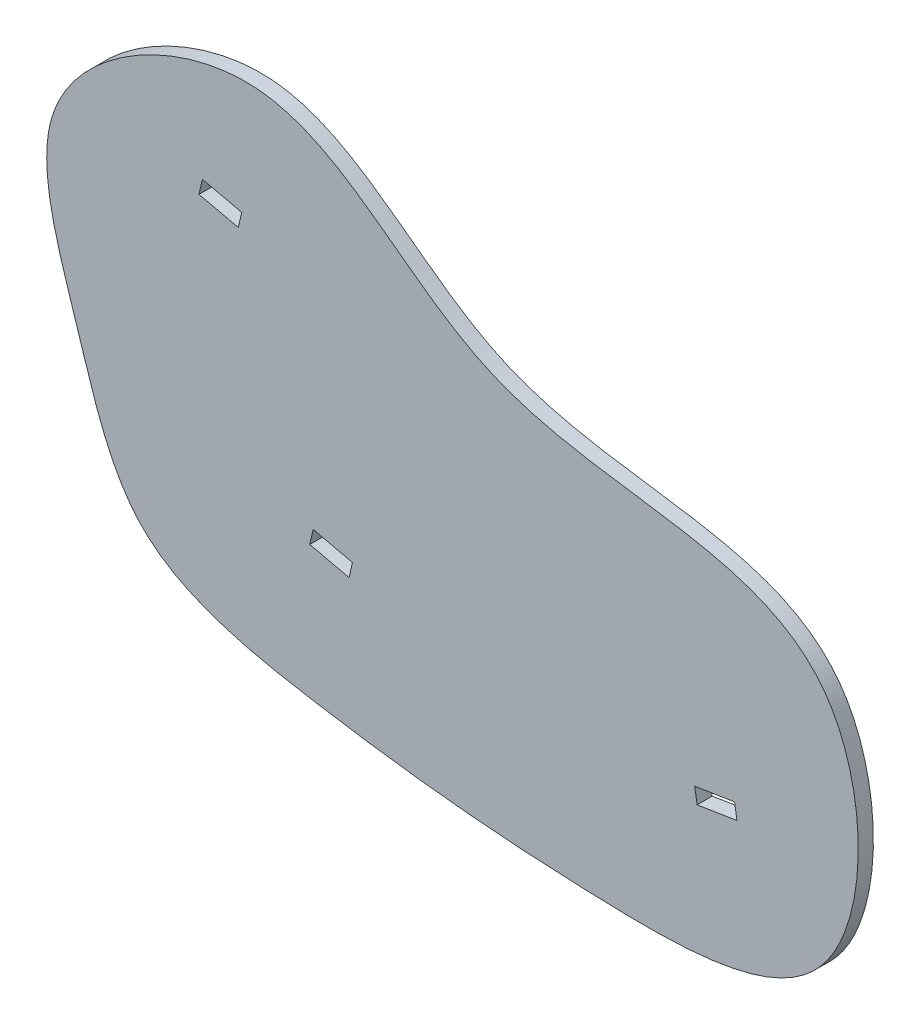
ISO-10303-21;
HEADER;
FILE_DESCRIPTION(('STEP AP214'),'2;1');
FILE_NAME('part.step','',(''),(''),'','','');
FILE_SCHEMA(('AUTOMOTIVE_DESIGN { 1 0 10303 214 1 1 1 1 }'));
ENDSEC;
DATA;
#1=APPLICATION_CONTEXT('core data for automotive mechanical design processes');
#2=APPLICATION_PROTOCOL_DEFINITION('international standard','automotive_design',2000,#1);
#3=PRODUCT_CONTEXT('',#1,'mechanical');
#4=PRODUCT('Part','Part','',(#3));
#5=PRODUCT_RELATED_PRODUCT_CATEGORY('part','',(#4));
#6=PRODUCT_DEFINITION_FORMATION('','',#4);
#7=PRODUCT_DEFINITION_CONTEXT('part definition',#1,'design');
#8=PRODUCT_DEFINITION('design','',#6,#7);
#9=PRODUCT_DEFINITION_SHAPE('','',#8);
#10=(LENGTH_UNIT() NAMED_UNIT(*) SI_UNIT(.MILLI.,.METRE.));
#11=(NAMED_UNIT(*) PLANE_ANGLE_UNIT() SI_UNIT($,.RADIAN.));
#12=(NAMED_UNIT(*) SI_UNIT($,.STERADIAN.) SOLID_ANGLE_UNIT());
#13=UNCERTAINTY_MEASURE_WITH_UNIT(LENGTH_MEASURE(1.E-05),#10,'distance_accuracy_value','');
#14=(GEOMETRIC_REPRESENTATION_CONTEXT(3) GLOBAL_UNCERTAINTY_ASSIGNED_CONTEXT((#13)) GLOBAL_UNIT_ASSIGNED_CONTEXT((#10,
#11,#12)) REPRESENTATION_CONTEXT('',''));
#15=CARTESIAN_POINT('',(0.,0.,0.));
#16=DIRECTION('',(0.,0.,1.));
#17=DIRECTION('',(1.,0.,0.));
#18=AXIS2_PLACEMENT_3D('',#15,#16,#17);
#19=CARTESIAN_POINT('',(-18.864168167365,58.9345778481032,3.));
#20=CARTESIAN_POINT('',(-34.265243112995,59.970351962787,3.));
#21=CARTESIAN_POINT('',(-68.7282783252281,40.4798839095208,3.));
#22=CARTESIAN_POINT('',(-54.0532926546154,1.33167403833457,3.));
#23=CARTESIAN_POINT('',(-44.653372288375,-33.4330483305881,3.));
#24=CARTESIAN_POINT('',(1.65807007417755,-42.880903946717,3.));
#25=CARTESIAN_POINT('',(42.2973272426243,-46.8441518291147,3.));
#26=CARTESIAN_POINT('',(102.968426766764,-46.4335205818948,3.));
#27=CARTESIAN_POINT('',(102.740932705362,33.6306735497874,3.));
#28=CARTESIAN_POINT('',(26.4618889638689,18.7347251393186,3.));
#29=CARTESIAN_POINT('',(-1.47242722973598,57.7649247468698,3.));
#30=CARTESIAN_POINT('',(-18.864168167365,58.9345778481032,3.));
#31=B_SPLINE_CURVE_WITH_KNOTS('',3,(#19,#20,#21,#22,#23,#24,#25,#26,#27,#28,#29,#30),
.UNSPECIFIED.,.T.,.F.,(4,1,1,1,1,1,1,1,1,4),(0.,0.110992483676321,0.194396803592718,
0.268191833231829,0.351801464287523,0.490835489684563,0.595467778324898,0.70673959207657,
0.874661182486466,1.),.UNSPECIFIED.);
#32=DIRECTION('',(0.,0.,-1.));
#33=VECTOR('',#32,1.);
#34=SURFACE_OF_LINEAR_EXTRUSION('',#31,#33);
#35=CARTESIAN_POINT('',(-18.864168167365,58.9345778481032,3.));
#36=VERTEX_POINT('',#35);
#37=EDGE_CURVE('E191',#36,#36,#31,.T.);
#38=ORIENTED_EDGE('',*,*,#37,.F.);
#39=EDGE_LOOP('',(#38));
#40=FACE_BOUND('',#39,.T.);
#41=CARTESIAN_POINT('',(-18.864168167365,58.9345778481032,0.));
#42=CARTESIAN_POINT('',(-34.265243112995,59.970351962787,0.));
#43=CARTESIAN_POINT('',(-68.7282783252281,40.4798839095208,0.));
#44=CARTESIAN_POINT('',(-54.0532926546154,1.33167403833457,0.));
#45=CARTESIAN_POINT('',(-44.653372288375,-33.4330483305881,0.));
#46=CARTESIAN_POINT('',(1.65807007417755,-42.880903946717,0.));
#47=CARTESIAN_POINT('',(42.2973272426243,-46.8441518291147,0.));
#48=CARTESIAN_POINT('',(102.968426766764,-46.4335205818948,0.));
#49=CARTESIAN_POINT('',(102.740932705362,33.6306735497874,0.));
#50=CARTESIAN_POINT('',(26.4618889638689,18.7347251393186,0.));
#51=CARTESIAN_POINT('',(-1.47242722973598,57.7649247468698,0.));
#52=CARTESIAN_POINT('',(-18.864168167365,58.9345778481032,0.));
#53=B_SPLINE_CURVE_WITH_KNOTS('',3,(#41,#42,#43,#44,#45,#46,#47,#48,#49,#50,#51,#52),
.UNSPECIFIED.,.T.,.F.,(4,1,1,1,1,1,1,1,1,4),(0.,0.110992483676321,0.194396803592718,
0.268191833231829,0.351801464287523,0.490835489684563,0.595467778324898,0.70673959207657,
0.874661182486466,1.),.UNSPECIFIED.);
#54=CARTESIAN_POINT('',(-18.864168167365,58.9345778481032,0.));
#55=VERTEX_POINT('',#54);
#56=EDGE_CURVE('E185',#55,#55,#53,.T.);
#57=ORIENTED_EDGE('',*,*,#56,.T.);
#58=EDGE_LOOP('',(#57));
#59=FACE_BOUND('',#58,.T.);
#60=ADVANCED_FACE('F32',(#40,#59),#34,.F.);
#61=CARTESIAN_POINT('',(54.4673267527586,-46.3127119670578,3.));
#62=DIRECTION('',(0.,0.,-1.));
#63=DIRECTION('',(-1.,0.,0.));
#64=AXIS2_PLACEMENT_3D('',#61,#62,#63);
#65=PLANE('',#64);
#66=DIRECTION('',(0.15643446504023,-0.987688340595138,0.));
#67=VECTOR('',#66,1.);
#68=CARTESIAN_POINT('',(68.1831600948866,-17.4597982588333,3.));
#69=LINE('',#68,#67);
#70=CARTESIAN_POINT('',(68.1831600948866,-17.4597982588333,3.));
#71=VERTEX_POINT('',#70);
#72=CARTESIAN_POINT('',(68.6524634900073,-20.4228632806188,3.));
#73=VERTEX_POINT('',#72);
#74=EDGE_CURVE('E155',#71,#73,#69,.T.);
#75=ORIENTED_EDGE('',*,*,#74,.F.);
#76=DIRECTION('',(-0.987688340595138,-0.15643446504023,0.));
#77=VECTOR('',#76,1.);
#78=CARTESIAN_POINT('',(68.1831600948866,-17.4597982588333,3.));
#79=LINE('',#78,#77);
#80=CARTESIAN_POINT('',(76.0846668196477,-16.2083225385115,3.));
#81=VERTEX_POINT('',#80);
#82=EDGE_CURVE('E47',#81,#71,#79,.T.);
#83=ORIENTED_EDGE('',*,*,#82,.F.);
#84=DIRECTION('',(-0.15643446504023,0.987688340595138,0.));
#85=VECTOR('',#84,1.);
#86=CARTESIAN_POINT('',(76.0846668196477,-16.2083225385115,3.));
#87=LINE('',#86,#85);
#88=CARTESIAN_POINT('',(76.5539702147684,-19.1713875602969,3.));
#89=VERTEX_POINT('',#88);
#90=EDGE_CURVE('E161',#89,#81,#87,.T.);
#91=ORIENTED_EDGE('',*,*,#90,.F.);
#92=DIRECTION('',(0.987688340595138,0.15643446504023,0.));
#93=VECTOR('',#92,1.);
#94=CARTESIAN_POINT('',(68.6524634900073,-20.4228632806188,3.));
#95=LINE('',#94,#93);
#96=EDGE_CURVE('E158',#73,#89,#95,.T.);
#97=ORIENTED_EDGE('',*,*,#96,.F.);
#98=EDGE_LOOP('',(#75,#83,#91,#97));
#99=FACE_BOUND('',#98,.T.);
#100=DIRECTION('',(0.223082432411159,0.974799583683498,0.));
#101=VECTOR('',#100,1.);
#102=CARTESIAN_POINT('',(-22.3177223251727,33.2345050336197,3.));
#103=LINE('',#102,#101);
#104=CARTESIAN_POINT('',(-22.3177223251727,33.2345050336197,3.));
#105=VERTEX_POINT('',#104);
#106=CARTESIAN_POINT('',(-21.6484750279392,36.1589037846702,3.));
#107=VERTEX_POINT('',#106);
#108=EDGE_CURVE('E137',#105,#107,#103,.T.);
#109=ORIENTED_EDGE('',*,*,#108,.F.);
#110=DIRECTION('',(0.974799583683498,-0.223082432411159,0.));
#111=VECTOR('',#110,1.);
#112=CARTESIAN_POINT('',(-30.1161189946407,35.019164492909,3.));
#113=LINE('',#112,#111);
#114=CARTESIAN_POINT('',(-30.1161189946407,35.019164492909,3.));
#115=VERTEX_POINT('',#114);
#116=EDGE_CURVE('E55',#115,#105,#113,.T.);
#117=ORIENTED_EDGE('',*,*,#116,.F.);
#118=DIRECTION('',(-0.223082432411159,-0.974799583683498,0.));
#119=VECTOR('',#118,1.);
#120=CARTESIAN_POINT('',(-30.1161189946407,35.019164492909,3.));
#121=LINE('',#120,#119);
#122=CARTESIAN_POINT('',(-29.4468716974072,37.9435632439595,3.));
#123=VERTEX_POINT('',#122);
#124=EDGE_CURVE('E144',#123,#115,#121,.T.);
#125=ORIENTED_EDGE('',*,*,#124,.F.);
#126=DIRECTION('',(-0.974799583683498,0.223082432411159,0.));
#127=VECTOR('',#126,1.);
#128=CARTESIAN_POINT('',(-29.4468716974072,37.9435632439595,3.));
#129=LINE('',#128,#127);
#130=EDGE_CURVE('E127',#107,#123,#129,.T.);
#131=ORIENTED_EDGE('',*,*,#130,.F.);
#132=EDGE_LOOP('',(#109,#117,#125,#131));
#133=FACE_BOUND('',#132,.T.);
#134=DIRECTION('',(0.223082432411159,0.974799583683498,0.));
#135=VECTOR('',#134,1.);
#136=CARTESIAN_POINT('',(-0.35436554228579,-15.9034304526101,3.));
#137=LINE('',#136,#135);
#138=CARTESIAN_POINT('',(-0.354365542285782,-15.9034304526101,3.));
#139=VERTEX_POINT('',#138);
#140=CARTESIAN_POINT('',(0.314881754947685,-12.9790317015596,3.));
#141=VERTEX_POINT('',#140);
#142=EDGE_CURVE('E173',#139,#141,#137,.T.);
#143=ORIENTED_EDGE('',*,*,#142,.F.);
#144=DIRECTION('',(0.974799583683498,-0.223082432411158,0.));
#145=VECTOR('',#144,1.);
#146=CARTESIAN_POINT('',(-8.15276221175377,-14.1187709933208,3.));
#147=LINE('',#146,#145);
#148=CARTESIAN_POINT('',(-8.15276221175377,-14.1187709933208,3.));
#149=VERTEX_POINT('',#148);
#150=EDGE_CURVE('E151',#149,#139,#147,.T.);
#151=ORIENTED_EDGE('',*,*,#150,.F.);
#152=DIRECTION('',(-0.223082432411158,-0.974799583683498,0.));
#153=VECTOR('',#152,1.);
#154=CARTESIAN_POINT('',(-8.15276221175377,-14.1187709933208,3.));
#155=LINE('',#154,#153);
#156=CARTESIAN_POINT('',(-7.4835149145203,-11.1943722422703,3.));
#157=VERTEX_POINT('',#156);
#158=EDGE_CURVE('E179',#157,#149,#155,.T.);
#159=ORIENTED_EDGE('',*,*,#158,.F.);
#160=DIRECTION('',(-0.974799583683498,0.223082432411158,0.));
#161=VECTOR('',#160,1.);
#162=CARTESIAN_POINT('',(-7.4835149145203,-11.1943722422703,3.));
#163=LINE('',#162,#161);
#164=EDGE_CURVE('E176',#141,#157,#163,.T.);
#165=ORIENTED_EDGE('',*,*,#164,.F.);
#166=EDGE_LOOP('',(#143,#151,#159,#165));
#167=FACE_BOUND('',#166,.T.);
#168=ORIENTED_EDGE('',*,*,#37,.T.);
#169=EDGE_LOOP('',(#168));
#170=FACE_BOUND('',#169,.T.);
#171=ADVANCED_FACE('F141',(#99,#133,#167,#170),#65,.F.);
#172=CARTESIAN_POINT('',(54.4673267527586,-46.3127119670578,0.));
#173=DIRECTION('',(0.,0.,-1.));
#174=DIRECTION('',(-1.,0.,0.));
#175=AXIS2_PLACEMENT_3D('',#172,#173,#174);
#176=PLANE('',#175);
#177=DIRECTION('',(0.987688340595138,0.15643446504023,0.));
#178=VECTOR('',#177,1.);
#179=CARTESIAN_POINT('',(50.3449567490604,-20.2850921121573,0.));
#180=LINE('',#179,#178);
#181=CARTESIAN_POINT('',(68.1831600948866,-17.4597982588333,0.));
#182=VERTEX_POINT('',#181);
#183=CARTESIAN_POINT('',(76.0846668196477,-16.2083225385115,0.));
#184=VERTEX_POINT('',#183);
#185=EDGE_CURVE('E11',#182,#184,#180,.T.);
#186=ORIENTED_EDGE('',*,*,#185,.F.);
#187=DIRECTION('',(-0.15643446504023,0.987688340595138,0.));
#188=VECTOR('',#187,1.);
#189=CARTESIAN_POINT('',(72.3055300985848,-43.4874181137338,0.));
#190=LINE('',#189,#188);
#191=CARTESIAN_POINT('',(68.6524634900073,-20.4228632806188,0.));
#192=VERTEX_POINT('',#191);
#193=EDGE_CURVE('E223',#192,#182,#190,.T.);
#194=ORIENTED_EDGE('',*,*,#193,.F.);
#195=DIRECTION('',(-0.987688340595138,-0.15643446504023,0.));
#196=VECTOR('',#195,1.);
#197=CARTESIAN_POINT('',(50.8142601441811,-23.2481571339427,0.));
#198=LINE('',#197,#196);
#199=CARTESIAN_POINT('',(76.5539702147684,-19.1713875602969,0.));
#200=VERTEX_POINT('',#199);
#201=EDGE_CURVE('E225',#200,#192,#198,.T.);
#202=ORIENTED_EDGE('',*,*,#201,.F.);
#203=DIRECTION('',(0.15643446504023,-0.987688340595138,0.));
#204=VECTOR('',#203,1.);
#205=CARTESIAN_POINT('',(80.2070368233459,-42.235942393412,0.));
#206=LINE('',#205,#204);
#207=EDGE_CURVE('E40',#184,#200,#206,.T.);
#208=ORIENTED_EDGE('',*,*,#207,.F.);
#209=EDGE_LOOP('',(#186,#194,#202,#208));
#210=FACE_BOUND('',#209,.T.);
#211=DIRECTION('',(-0.974799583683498,0.223082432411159,0.));
#212=VECTOR('',#211,1.);
#213=CARTESIAN_POINT('',(67.9444500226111,12.5780487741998,0.));
#214=LINE('',#213,#212);
#215=CARTESIAN_POINT('',(-22.3177223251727,33.2345050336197,0.));
#216=VERTEX_POINT('',#215);
#217=CARTESIAN_POINT('',(-30.1161189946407,35.019164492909,0.));
#218=VERTEX_POINT('',#217);
#219=EDGE_CURVE('E221',#216,#218,#214,.T.);
#220=ORIENTED_EDGE('',*,*,#219,.F.);
#221=DIRECTION('',(-0.223082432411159,-0.974799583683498,0.));
#222=VECTOR('',#221,1.);
#223=CARTESIAN_POINT('',(-35.7948455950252,-25.6562557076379,0.));
#224=LINE('',#223,#222);
#225=CARTESIAN_POINT('',(-21.6484750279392,36.1589037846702,0.));
#226=VERTEX_POINT('',#225);
#227=EDGE_CURVE('E216',#226,#216,#224,.T.);
#228=ORIENTED_EDGE('',*,*,#227,.F.);
#229=DIRECTION('',(0.974799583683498,-0.223082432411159,0.));
#230=VECTOR('',#229,1.);
#231=CARTESIAN_POINT('',(68.6136973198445,15.5024475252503,0.));
#232=LINE('',#231,#230);
#233=CARTESIAN_POINT('',(-29.4468716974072,37.9435632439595,0.));
#234=VERTEX_POINT('',#233);
#235=EDGE_CURVE('E130',#234,#226,#232,.T.);
#236=ORIENTED_EDGE('',*,*,#235,.F.);
#237=DIRECTION('',(0.223082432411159,0.974799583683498,0.));
#238=VECTOR('',#237,1.);
#239=CARTESIAN_POINT('',(-43.5932422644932,-23.8715962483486,0.));
#240=LINE('',#239,#238);
#241=EDGE_CURVE('E219',#218,#234,#240,.T.);
#242=ORIENTED_EDGE('',*,*,#241,.F.);
#243=EDGE_LOOP('',(#220,#228,#236,#242));
#244=FACE_BOUND('',#243,.T.);
#245=DIRECTION('',(-0.974799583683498,0.223082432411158,0.));
#246=VECTOR('',#245,1.);
#247=CARTESIAN_POINT('',(58.3519054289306,-29.3383333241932,0.));
#248=LINE('',#247,#246);
#249=CARTESIAN_POINT('',(-0.35436554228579,-15.9034304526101,0.));
#250=VERTEX_POINT('',#249);
#251=CARTESIAN_POINT('',(-8.15276221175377,-14.1187709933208,0.));
#252=VERTEX_POINT('',#251);
#253=EDGE_CURVE('E214',#250,#252,#248,.T.);
#254=ORIENTED_EDGE('',*,*,#253,.F.);
#255=DIRECTION('',(-0.223082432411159,-0.974799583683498,0.));
#256=VECTOR('',#255,1.);
#257=CARTESIAN_POINT('',(-4.23894421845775,-32.8778090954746,0.));
#258=LINE('',#257,#256);
#259=CARTESIAN_POINT('',(0.314881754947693,-12.9790317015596,0.));
#260=VERTEX_POINT('',#259);
#261=EDGE_CURVE('E197',#260,#250,#258,.T.);
#262=ORIENTED_EDGE('',*,*,#261,.F.);
#263=DIRECTION('',(0.974799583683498,-0.223082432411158,0.));
#264=VECTOR('',#263,1.);
#265=CARTESIAN_POINT('',(59.0211527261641,-26.4139345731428,0.));
#266=LINE('',#265,#264);
#267=CARTESIAN_POINT('',(-7.4835149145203,-11.1943722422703,0.));
#268=VERTEX_POINT('',#267);
#269=EDGE_CURVE('E209',#268,#260,#266,.T.);
#270=ORIENTED_EDGE('',*,*,#269,.F.);
#271=DIRECTION('',(0.223082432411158,0.974799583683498,0.));
#272=VECTOR('',#271,1.);
#273=CARTESIAN_POINT('',(-12.0373408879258,-31.0931496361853,0.));
#274=LINE('',#273,#272);
#275=EDGE_CURVE('E212',#252,#268,#274,.T.);
#276=ORIENTED_EDGE('',*,*,#275,.F.);
#277=EDGE_LOOP('',(#254,#262,#270,#276));
#278=FACE_BOUND('',#277,.T.);
#279=ORIENTED_EDGE('',*,*,#56,.F.);
#280=EDGE_LOOP('',(#279));
#281=FACE_BOUND('',#280,.T.);
#282=ADVANCED_FACE('F240',(#210,#244,#278,#281),#176,.T.);
#283=CARTESIAN_POINT('',(-8.15276221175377,-14.1187709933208,-7.));
#284=DIRECTION('',(-0.223082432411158,-0.974799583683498,0.));
#285=DIRECTION('',(0.974799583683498,-0.223082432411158,0.));
#286=AXIS2_PLACEMENT_3D('',#283,#284,#285);
#287=PLANE('',#286);
#288=ORIENTED_EDGE('',*,*,#253,.T.);
#289=DIRECTION('',(0.,0.,1.));
#290=VECTOR('',#289,1.);
#291=CARTESIAN_POINT('',(-8.15276221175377,-14.1187709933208,-7.));
#292=LINE('',#291,#290);
#293=EDGE_CURVE('E183',#252,#149,#292,.T.);
#294=ORIENTED_EDGE('',*,*,#293,.T.);
#295=ORIENTED_EDGE('',*,*,#150,.T.);
#296=DIRECTION('',(0.,0.,1.));
#297=VECTOR('',#296,1.);
#298=CARTESIAN_POINT('',(-0.35436554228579,-15.9034304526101,-7.));
#299=LINE('',#298,#297);
#300=EDGE_CURVE('E182',#250,#139,#299,.T.);
#301=ORIENTED_EDGE('',*,*,#300,.F.);
#302=EDGE_LOOP('',(#288,#294,#295,#301));
#303=FACE_BOUND('',#302,.T.);
#304=ADVANCED_FACE('F253',(#303),#287,.F.);
#305=CARTESIAN_POINT('',(-8.15276221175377,-14.1187709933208,-7.));
#306=DIRECTION('',(-0.974799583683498,0.223082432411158,0.));
#307=DIRECTION('',(-0.223082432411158,-0.974799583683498,0.));
#308=AXIS2_PLACEMENT_3D('',#305,#306,#307);
#309=PLANE('',#308);
#310=ORIENTED_EDGE('',*,*,#275,.T.);
#311=DIRECTION('',(0.,0.,1.));
#312=VECTOR('',#311,1.);
#313=CARTESIAN_POINT('',(-7.4835149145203,-11.1943722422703,-7.));
#314=LINE('',#313,#312);
#315=EDGE_CURVE('E186',#268,#157,#314,.T.);
#316=ORIENTED_EDGE('',*,*,#315,.T.);
#317=ORIENTED_EDGE('',*,*,#158,.T.);
#318=ORIENTED_EDGE('',*,*,#293,.F.);
#319=EDGE_LOOP('',(#310,#316,#317,#318));
#320=FACE_BOUND('',#319,.T.);
#321=ADVANCED_FACE('F258',(#320),#309,.F.);
#322=CARTESIAN_POINT('',(-7.4835149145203,-11.1943722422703,-7.));
#323=DIRECTION('',(0.223082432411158,0.974799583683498,0.));
#324=DIRECTION('',(-0.974799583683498,0.223082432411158,0.));
#325=AXIS2_PLACEMENT_3D('',#322,#323,#324);
#326=PLANE('',#325);
#327=ORIENTED_EDGE('',*,*,#269,.T.);
#328=DIRECTION('',(0.,0.,1.));
#329=VECTOR('',#328,1.);
#330=CARTESIAN_POINT('',(0.314881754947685,-12.9790317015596,-7.));
#331=LINE('',#330,#329);
#332=EDGE_CURVE('E188',#260,#141,#331,.T.);
#333=ORIENTED_EDGE('',*,*,#332,.T.);
#334=ORIENTED_EDGE('',*,*,#164,.T.);
#335=ORIENTED_EDGE('',*,*,#315,.F.);
#336=EDGE_LOOP('',(#327,#333,#334,#335));
#337=FACE_BOUND('',#336,.T.);
#338=ADVANCED_FACE('F264',(#337),#326,.F.);
#339=CARTESIAN_POINT('',(-0.35436554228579,-15.9034304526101,-7.));
#340=DIRECTION('',(0.974799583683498,-0.223082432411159,0.));
#341=DIRECTION('',(0.223082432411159,0.974799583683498,0.));
#342=AXIS2_PLACEMENT_3D('',#339,#340,#341);
#343=PLANE('',#342);
#344=ORIENTED_EDGE('',*,*,#261,.T.);
#345=ORIENTED_EDGE('',*,*,#300,.T.);
#346=ORIENTED_EDGE('',*,*,#142,.T.);
#347=ORIENTED_EDGE('',*,*,#332,.F.);
#348=EDGE_LOOP('',(#344,#345,#346,#347));
#349=FACE_BOUND('',#348,.T.);
#350=ADVANCED_FACE('F260',(#349),#343,.F.);
#351=CARTESIAN_POINT('',(-30.1161189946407,35.019164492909,-7.));
#352=DIRECTION('',(-0.223082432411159,-0.974799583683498,0.));
#353=DIRECTION('',(0.974799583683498,-0.223082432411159,0.));
#354=AXIS2_PLACEMENT_3D('',#351,#352,#353);
#355=PLANE('',#354);
#356=ORIENTED_EDGE('',*,*,#219,.T.);
#357=DIRECTION('',(0.,0.,1.));
#358=VECTOR('',#357,1.);
#359=CARTESIAN_POINT('',(-30.1161189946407,35.019164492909,-7.));
#360=LINE('',#359,#358);
#361=EDGE_CURVE('E149',#218,#115,#360,.T.);
#362=ORIENTED_EDGE('',*,*,#361,.T.);
#363=ORIENTED_EDGE('',*,*,#116,.T.);
#364=DIRECTION('',(0.,0.,1.));
#365=VECTOR('',#364,1.);
#366=CARTESIAN_POINT('',(-22.3177223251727,33.2345050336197,-7.));
#367=LINE('',#366,#365);
#368=EDGE_CURVE('E134',#216,#105,#367,.T.);
#369=ORIENTED_EDGE('',*,*,#368,.F.);
#370=EDGE_LOOP('',(#356,#362,#363,#369));
#371=FACE_BOUND('',#370,.T.);
#372=ADVANCED_FACE('F263',(#371),#355,.F.);
#373=CARTESIAN_POINT('',(-30.1161189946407,35.019164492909,-7.));
#374=DIRECTION('',(-0.974799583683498,0.223082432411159,0.));
#375=DIRECTION('',(-0.223082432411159,-0.974799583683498,0.));
#376=AXIS2_PLACEMENT_3D('',#373,#374,#375);
#377=PLANE('',#376);
#378=ORIENTED_EDGE('',*,*,#241,.T.);
#379=DIRECTION('',(0.,0.,1.));
#380=VECTOR('',#379,1.);
#381=CARTESIAN_POINT('',(-29.4468716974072,37.9435632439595,-7.));
#382=LINE('',#381,#380);
#383=EDGE_CURVE('E133',#234,#123,#382,.T.);
#384=ORIENTED_EDGE('',*,*,#383,.T.);
#385=ORIENTED_EDGE('',*,*,#124,.T.);
#386=ORIENTED_EDGE('',*,*,#361,.F.);
#387=EDGE_LOOP('',(#378,#384,#385,#386));
#388=FACE_BOUND('',#387,.T.);
#389=ADVANCED_FACE('F282',(#388),#377,.F.);
#390=CARTESIAN_POINT('',(-29.4468716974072,37.9435632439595,-7.));
#391=DIRECTION('',(0.223082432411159,0.974799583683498,0.));
#392=DIRECTION('',(-0.974799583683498,0.223082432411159,0.));
#393=AXIS2_PLACEMENT_3D('',#390,#391,#392);
#394=PLANE('',#393);
#395=ORIENTED_EDGE('',*,*,#235,.T.);
#396=DIRECTION('',(0.,0.,1.));
#397=VECTOR('',#396,1.);
#398=CARTESIAN_POINT('',(-21.6484750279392,36.1589037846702,-7.));
#399=LINE('',#398,#397);
#400=EDGE_CURVE('E122',#226,#107,#399,.T.);
#401=ORIENTED_EDGE('',*,*,#400,.T.);
#402=ORIENTED_EDGE('',*,*,#130,.T.);
#403=ORIENTED_EDGE('',*,*,#383,.F.);
#404=EDGE_LOOP('',(#395,#401,#402,#403));
#405=FACE_BOUND('',#404,.T.);
#406=ADVANCED_FACE('F124',(#405),#394,.F.);
#407=CARTESIAN_POINT('',(-22.3177223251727,33.2345050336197,-7.));
#408=DIRECTION('',(0.974799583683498,-0.223082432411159,0.));
#409=DIRECTION('',(0.223082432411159,0.974799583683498,0.));
#410=AXIS2_PLACEMENT_3D('',#407,#408,#409);
#411=PLANE('',#410);
#412=ORIENTED_EDGE('',*,*,#227,.T.);
#413=ORIENTED_EDGE('',*,*,#368,.T.);
#414=ORIENTED_EDGE('',*,*,#108,.T.);
#415=ORIENTED_EDGE('',*,*,#400,.F.);
#416=EDGE_LOOP('',(#412,#413,#414,#415));
#417=FACE_BOUND('',#416,.T.);
#418=ADVANCED_FACE('F138',(#417),#411,.F.);
#419=CARTESIAN_POINT('',(68.1831600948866,-17.4597982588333,-7.));
#420=DIRECTION('',(-0.15643446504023,0.987688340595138,0.));
#421=DIRECTION('',(-0.987688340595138,-0.15643446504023,0.));
#422=AXIS2_PLACEMENT_3D('',#419,#420,#421);
#423=PLANE('',#422);
#424=ORIENTED_EDGE('',*,*,#185,.T.);
#425=DIRECTION('',(0.,0.,1.));
#426=VECTOR('',#425,1.);
#427=CARTESIAN_POINT('',(76.0846668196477,-16.2083225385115,-7.));
#428=LINE('',#427,#426);
#429=EDGE_CURVE('E165',#184,#81,#428,.T.);
#430=ORIENTED_EDGE('',*,*,#429,.T.);
#431=ORIENTED_EDGE('',*,*,#82,.T.);
#432=DIRECTION('',(0.,0.,1.));
#433=VECTOR('',#432,1.);
#434=CARTESIAN_POINT('',(68.1831600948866,-17.4597982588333,-7.));
#435=LINE('',#434,#433);
#436=EDGE_CURVE('E164',#182,#71,#435,.T.);
#437=ORIENTED_EDGE('',*,*,#436,.F.);
#438=EDGE_LOOP('',(#424,#430,#431,#437));
#439=FACE_BOUND('',#438,.T.);
#440=ADVANCED_FACE('F245',(#439),#423,.F.);
#441=CARTESIAN_POINT('',(76.0846668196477,-16.2083225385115,-7.));
#442=DIRECTION('',(0.987688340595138,0.15643446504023,0.));
#443=DIRECTION('',(-0.15643446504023,0.987688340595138,0.));
#444=AXIS2_PLACEMENT_3D('',#441,#442,#443);
#445=PLANE('',#444);
#446=ORIENTED_EDGE('',*,*,#207,.T.);
#447=DIRECTION('',(0.,0.,1.));
#448=VECTOR('',#447,1.);
#449=CARTESIAN_POINT('',(76.5539702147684,-19.1713875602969,-7.));
#450=LINE('',#449,#448);
#451=EDGE_CURVE('E167',#200,#89,#450,.T.);
#452=ORIENTED_EDGE('',*,*,#451,.T.);
#453=ORIENTED_EDGE('',*,*,#90,.T.);
#454=ORIENTED_EDGE('',*,*,#429,.F.);
#455=EDGE_LOOP('',(#446,#452,#453,#454));
#456=FACE_BOUND('',#455,.T.);
#457=ADVANCED_FACE('F231',(#456),#445,.F.);
#458=CARTESIAN_POINT('',(68.6524634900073,-20.4228632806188,-7.));
#459=DIRECTION('',(0.15643446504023,-0.987688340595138,0.));
#460=DIRECTION('',(0.987688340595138,0.15643446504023,0.));
#461=AXIS2_PLACEMENT_3D('',#458,#459,#460);
#462=PLANE('',#461);
#463=ORIENTED_EDGE('',*,*,#201,.T.);
#464=DIRECTION('',(0.,0.,1.));
#465=VECTOR('',#464,1.);
#466=CARTESIAN_POINT('',(68.6524634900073,-20.4228632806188,-7.));
#467=LINE('',#466,#465);
#468=EDGE_CURVE('E169',#192,#73,#467,.T.);
#469=ORIENTED_EDGE('',*,*,#468,.T.);
#470=ORIENTED_EDGE('',*,*,#96,.T.);
#471=ORIENTED_EDGE('',*,*,#451,.F.);
#472=EDGE_LOOP('',(#463,#469,#470,#471));
#473=FACE_BOUND('',#472,.T.);
#474=ADVANCED_FACE('F236',(#473),#462,.F.);
#475=CARTESIAN_POINT('',(68.1831600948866,-17.4597982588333,-7.));
#476=DIRECTION('',(-0.987688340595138,-0.15643446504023,0.));
#477=DIRECTION('',(0.15643446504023,-0.987688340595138,0.));
#478=AXIS2_PLACEMENT_3D('',#475,#476,#477);
#479=PLANE('',#478);
#480=ORIENTED_EDGE('',*,*,#193,.T.);
#481=ORIENTED_EDGE('',*,*,#436,.T.);
#482=ORIENTED_EDGE('',*,*,#74,.T.);
#483=ORIENTED_EDGE('',*,*,#468,.F.);
#484=EDGE_LOOP('',(#480,#481,#482,#483));
#485=FACE_BOUND('',#484,.T.);
#486=ADVANCED_FACE('F243',(#485),#479,.F.);
#487=CLOSED_SHELL('',(#60,#171,#282,#304,#321,#338,#350,#372,#389,#406,#418,#440,#457,#474,#486));
#488=MANIFOLD_SOLID_BREP('B2',#487);
#489=ADVANCED_BREP_SHAPE_REPRESENTATION('',(#18,#488),#14);
#490=SHAPE_DEFINITION_REPRESENTATION(#9,#489);
ENDSEC;
END-ISO-10303-21;
